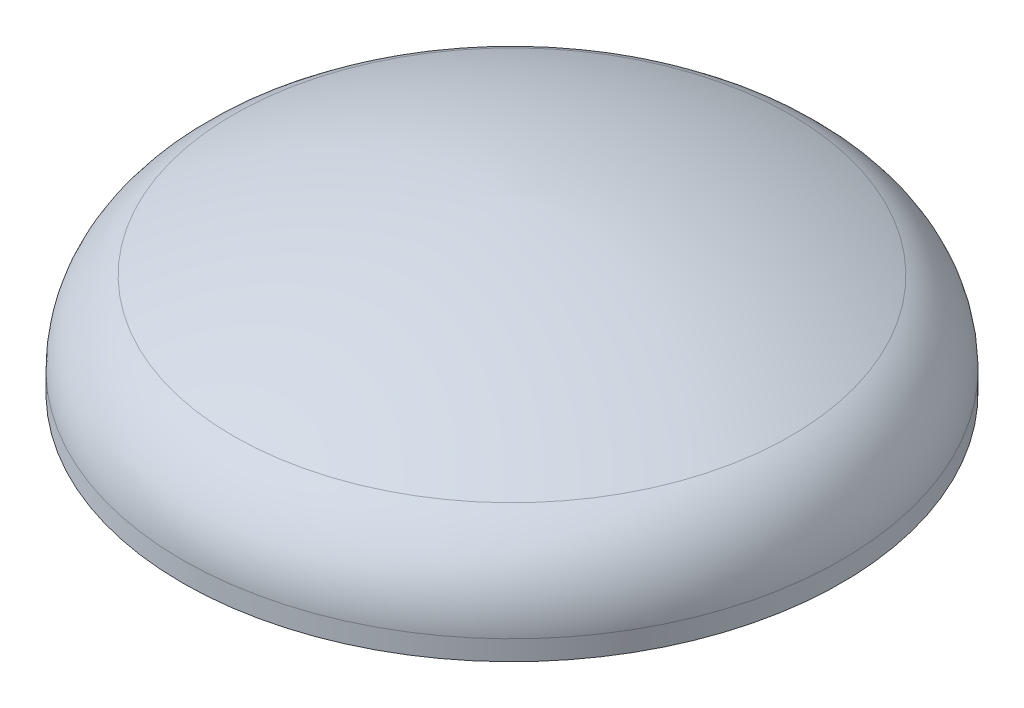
from build123d import *


with BuildPart() as part:
    # Esquisse1 → R_volution1 (revolve)
    with BuildSketch(Plane.XY, mode=Mode.PRIVATE) as r_volution1_sk:
        with BuildLine():
            Line((-35.15, 0.67074096), (-35.15, 4.636716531))
            ThreePointArc((-35.15, 4.636716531), (-33.996018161, 8.665603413), (-30.884052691, 11.472607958))
            ThreePointArc((-30.884052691, 11.472607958), (-15.848996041, 16.954391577), (0, 19.17074096))
            Line((0, 19.17074096), (0, 22.07074096))
            ThreePointArc((0, 22.07074096), (-16.503004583, 19.779258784), (-32.158396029, 14.077612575))
            ThreePointArc((-32.158396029, 14.077612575), (-36.456261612, 10.200921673), (-38.05, 4.636716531))
            Line((-38.05, 4.636716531), (-38.05, 2.345056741))
            Line((-38.05, 2.345056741), (-35.15, 0.67074096))
        make_face()
    revolve(r_volution1_sk.sketch.rotate(Axis((0, 18.166606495, 0), (0, -1, 0)), 270), axis=Axis((0, 18.166606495, 0), (0, -1, 0)))


solid = part.part
